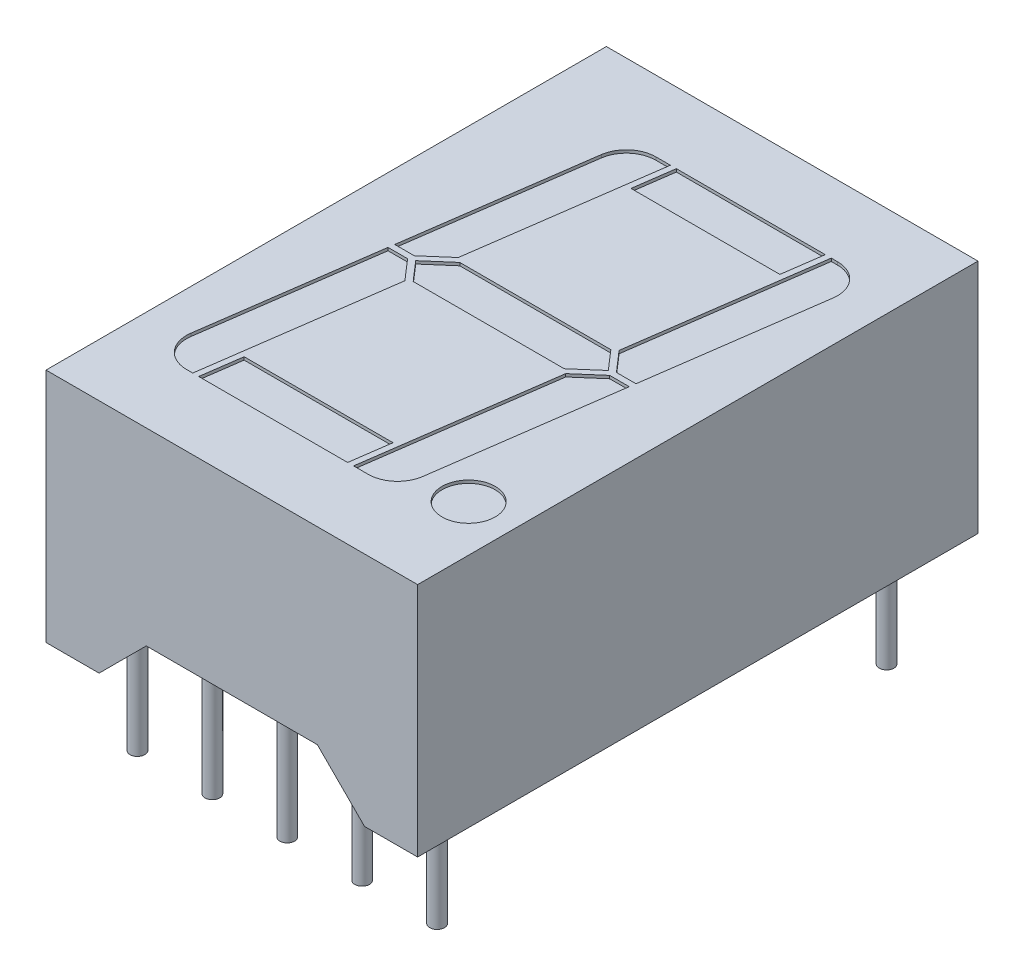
from build123d import *

# Parameters (mm, degrees)
EXTRUDE_1_DEPTH      = 9.5
EXTRUDE_2_DEPTH      = 2.5
EXTRUDE_2_DEPTH_BACK = 3.5
SKETCH_2_R           = 0.25
SKETCH_3_R           = 0.9
CUT_EXTRUDE_3_DEPTH  = 0.1


with BuildPart() as part:
    # Sketch 1 → Extrude 1 (new, symmetric)
    with BuildSketch(Plane.XY):
        Polygon((-6.3, 0), (-4.5, 0), (-2.9, 1.6), (2.9, 1.6), (4.5, 0), (6.3, 0), (6.3, 8), (-6.3, 8), align=None)
    extrude(amount=EXTRUDE_1_DEPTH, both=True)

    # Sketch 2 → Extrude 2 (add, two sides: drawn at the far end of the back side and taken through both)
    with BuildSketch(Plane(origin=(0, 0, 0), x_dir=(1, 0, 0), z_dir=(0, 1, 0)).offset(-EXTRUDE_2_DEPTH_BACK)):
        with Locations(Location((-5.08, 7.62, 0), (0, 0, 270))):
            Circle(SKETCH_2_R)
        with Locations(Location((-2.54, 7.62, 0), (0, 0, 180))):
            Circle(SKETCH_2_R)
        with Locations(Location((0, 7.62, 0), (0, 0, 180))):
            Circle(SKETCH_2_R)
        with Locations(Location((2.54, 7.62, 0), (0, 0, 180))):
            Circle(SKETCH_2_R)
        with Locations(Location((5.08, 7.62, 0), (0, 0, 180))):
            Circle(SKETCH_2_R)
        with Locations(Location((-5.08, -7.62, 0), (0, 0, 270))):
            Circle(SKETCH_2_R)
        with Locations(Location((-2.54, -7.62, 0), (0, 0, 180))):
            Circle(SKETCH_2_R)
        with Locations(Location((0, -7.62, 0), (0, 0, 180))):
            Circle(SKETCH_2_R)
        with Locations(Location((2.54, -7.62, 0), (0, 0, 180))):
            Circle(SKETCH_2_R)
        with Locations(Location((5.08, -7.62, 0), (0, 0, 180))):
            Circle(SKETCH_2_R)
    extrude(amount=EXTRUDE_2_DEPTH + EXTRUDE_2_DEPTH_BACK)

    # Sketch 3 → Cut-Extrude 3 (cut)
    with BuildSketch(Plane(origin=(0, 8, 0), x_dir=(-1, 0, 0), z_dir=(0, 1, 0))):
        with Locations((-4.728694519, 6.2)):
            Circle(SKETCH_3_R)
        with BuildLine():
            Line((4.927541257, 5.960826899), (4.103855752, 0.1))
            Line((4.103855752, 0.1), (3.440588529, 0.1))
            Line((3.440588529, 0.1), (2.8380097, 0.793187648))
            Line((2.8380097, 0.793187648), (3.724374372, 7.1))
            Line((3.724374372, 7.1), (3.937273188, 7.1))
            ThreePointArc((3.937273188, 7.1), (4.691982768, 6.756059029), (4.927541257, 5.960826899))
        make_face()
        with BuildLine():
            Line((4.075747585, -0.1), (3.212943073, -6.239173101))
            ThreePointArc((3.212943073, -6.239173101), (2.878734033, -6.85470958), (2.222675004, -7.1))
            Line((2.222675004, -7.1), (1.728694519, -7.1))
            Line((1.728694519, -7.1), (2.615059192, -0.793187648))
            Line((2.615059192, -0.793187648), (3.412480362, -0.1))
            Line((3.412480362, -0.1), (4.075747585, -0.1))
        make_face()
        with BuildLine():
            Line((-2.8380097, -0.793187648), (-3.724374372, -7.1))
            Line((-3.724374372, -7.1), (-3.937273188, -7.1))
            ThreePointArc((-3.937273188, -7.1), (-4.691982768, -6.756059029), (-4.927541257, -5.960826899))
            Line((-4.927541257, -5.960826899), (-4.103855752, -0.1))
            Line((-4.103855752, -0.1), (-3.440588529, -0.1))
            Line((-3.440588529, -0.1), (-2.8380097, -0.793187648))
        make_face()
        with BuildLine():
            Line((-1.728694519, 7.1), (-2.615059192, 0.793187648))
            Line((-2.615059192, 0.793187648), (-3.412480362, 0.1))
            Line((-3.412480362, 0.1), (-4.075747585, 0.1))
            Line((-4.075747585, 0.1), (-3.212943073, 6.239173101))
            ThreePointArc((-3.212943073, 6.239173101), (-2.878734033, 6.85470958), (-2.222675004, 7.1))
            Line((-2.222675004, 7.1), (-1.728694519, 7.1))
        make_face()
        Polygon((3.522408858, 7.1), (3.332678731, 5.75), (-1.716459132, 5.75), (-1.526729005, 7.1), align=None)
        Polygon((1.716459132, -5.75), (-3.332678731, -5.75), (-3.522408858, -7.1), (1.526729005, -7.1), align=None)
        Polygon((2.446167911, -0.675), (-2.675746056, -0.675), (-3.245363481, -0.01973011), (-2.446167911, 0.675), (2.675746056, 0.675), (3.245363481, 0.01973011), align=None)
    extrude(amount=-CUT_EXTRUDE_3_DEPTH, mode=Mode.SUBTRACT)


solid = part.part
